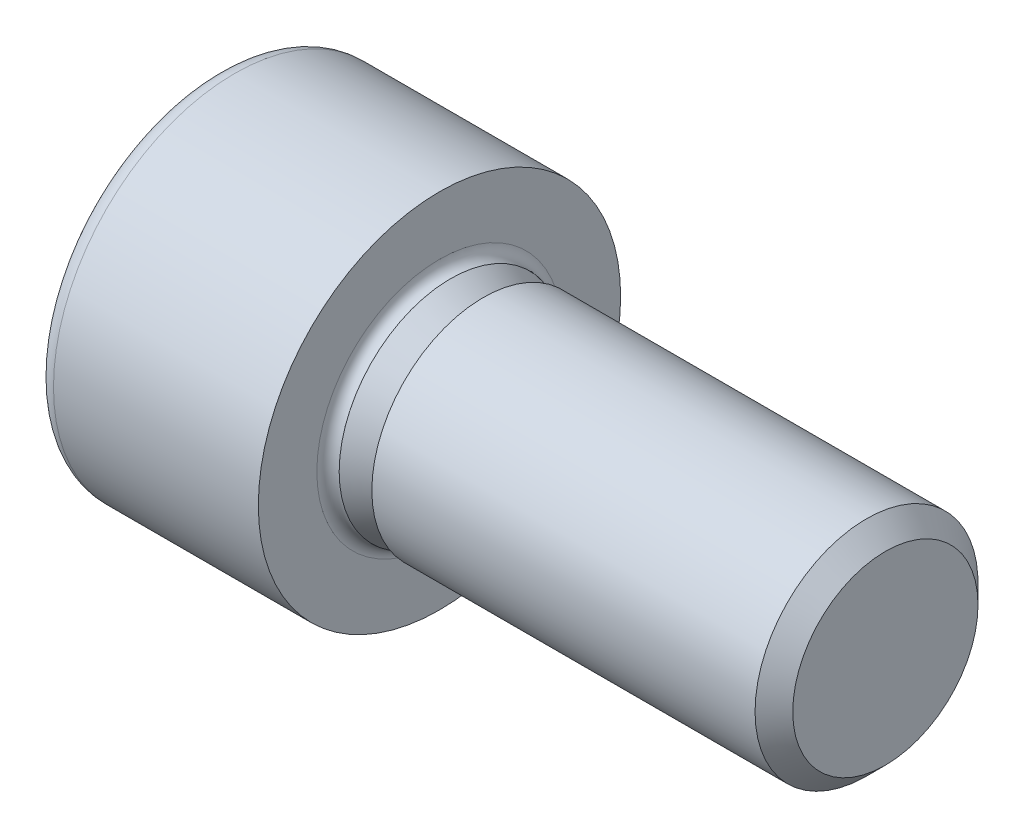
ISO-10303-21;
HEADER;
FILE_DESCRIPTION(('STEP AP214'),'2;1');
FILE_NAME('part.step','',(''),(''),'','','');
FILE_SCHEMA(('AUTOMOTIVE_DESIGN { 1 0 10303 214 1 1 1 1 }'));
ENDSEC;
DATA;
#1=APPLICATION_CONTEXT('core data for automotive mechanical design processes');
#2=APPLICATION_PROTOCOL_DEFINITION('international standard','automotive_design',2000,#1);
#3=PRODUCT_CONTEXT('',#1,'mechanical');
#4=PRODUCT('Part','Part','',(#3));
#5=PRODUCT_RELATED_PRODUCT_CATEGORY('part','',(#4));
#6=PRODUCT_DEFINITION_FORMATION('','',#4);
#7=PRODUCT_DEFINITION_CONTEXT('part definition',#1,'design');
#8=PRODUCT_DEFINITION('design','',#6,#7);
#9=PRODUCT_DEFINITION_SHAPE('','',#8);
#10=(LENGTH_UNIT() NAMED_UNIT(*) SI_UNIT(.MILLI.,.METRE.));
#11=(NAMED_UNIT(*) PLANE_ANGLE_UNIT() SI_UNIT($,.RADIAN.));
#12=(NAMED_UNIT(*) SI_UNIT($,.STERADIAN.) SOLID_ANGLE_UNIT());
#13=UNCERTAINTY_MEASURE_WITH_UNIT(LENGTH_MEASURE(1.E-05),#10,'distance_accuracy_value','');
#14=(GEOMETRIC_REPRESENTATION_CONTEXT(3) GLOBAL_UNCERTAINTY_ASSIGNED_CONTEXT((#13)) GLOBAL_UNIT_ASSIGNED_CONTEXT((#10,
#11,#12)) REPRESENTATION_CONTEXT('',''));
#15=CARTESIAN_POINT('',(0.,0.,0.));
#16=DIRECTION('',(0.,0.,1.));
#17=DIRECTION('',(1.,0.,0.));
#18=AXIS2_PLACEMENT_3D('',#15,#16,#17);
#19=CARTESIAN_POINT('',(-144.,44.,28.));
#20=DIRECTION('',(-1.,0.,0.));
#21=DIRECTION('',(0.,0.,1.));
#22=AXIS2_PLACEMENT_3D('',#19,#20,#21);
#23=PLANE('',#22);
#24=CARTESIAN_POINT('',(-144.,44.,28.));
#25=DIRECTION('',(-1.,0.,0.));
#26=DIRECTION('',(0.,0.,1.));
#27=AXIS2_PLACEMENT_3D('',#24,#25,#26);
#28=CIRCLE('',#27,5.85);
#29=CARTESIAN_POINT('',(-144.,44.,33.85));
#30=VERTEX_POINT('',#29);
#31=EDGE_CURVE('E11',#30,#30,#28,.T.);
#32=ORIENTED_EDGE('',*,*,#31,.T.);
#33=EDGE_LOOP('',(#32));
#34=FACE_BOUND('',#33,.T.);
#35=DIRECTION('',(0.,0.,1.));
#36=VECTOR('',#35,1.);
#37=CARTESIAN_POINT('',(-144.,46.9999986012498,26.26795));
#38=LINE('',#37,#36);
#39=CARTESIAN_POINT('',(-144.,46.9999986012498,26.26795));
#40=VERTEX_POINT('',#39);
#41=CARTESIAN_POINT('',(-144.,46.9999986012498,29.73205));
#42=VERTEX_POINT('',#41);
#43=EDGE_CURVE('E91',#40,#42,#38,.T.);
#44=ORIENTED_EDGE('',*,*,#43,.T.);
#45=DIRECTION('',(0.,-0.866025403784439,0.5));
#46=VECTOR('',#45,1.);
#47=CARTESIAN_POINT('',(-144.,46.9999986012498,29.73205));
#48=LINE('',#47,#46);
#49=CARTESIAN_POINT('',(-144.,44.,31.4641));
#50=VERTEX_POINT('',#49);
#51=EDGE_CURVE('E30',#42,#50,#48,.T.);
#52=ORIENTED_EDGE('',*,*,#51,.T.);
#53=DIRECTION('',(0.,-0.866025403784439,-0.5));
#54=VECTOR('',#53,1.);
#55=CARTESIAN_POINT('',(-144.,44.,31.4641));
#56=LINE('',#55,#54);
#57=CARTESIAN_POINT('',(-144.,41.0000013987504,29.73205));
#58=VERTEX_POINT('',#57);
#59=EDGE_CURVE('E169',#50,#58,#56,.T.);
#60=ORIENTED_EDGE('',*,*,#59,.T.);
#61=DIRECTION('',(0.,0.,-1.));
#62=VECTOR('',#61,1.);
#63=CARTESIAN_POINT('',(-144.,41.0000013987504,29.73205));
#64=LINE('',#63,#62);
#65=CARTESIAN_POINT('',(-144.,41.0000013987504,26.26795));
#66=VERTEX_POINT('',#65);
#67=EDGE_CURVE('E165',#58,#66,#64,.T.);
#68=ORIENTED_EDGE('',*,*,#67,.T.);
#69=DIRECTION('',(0.,0.866025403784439,-0.5));
#70=VECTOR('',#69,1.);
#71=CARTESIAN_POINT('',(-144.,41.0000013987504,26.26795));
#72=LINE('',#71,#70);
#73=CARTESIAN_POINT('',(-144.,44.,24.5359));
#74=VERTEX_POINT('',#73);
#75=EDGE_CURVE('E160',#66,#74,#72,.T.);
#76=ORIENTED_EDGE('',*,*,#75,.T.);
#77=DIRECTION('',(0.,0.866025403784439,0.5));
#78=VECTOR('',#77,1.);
#79=CARTESIAN_POINT('',(-144.,44.,24.5359));
#80=LINE('',#79,#78);
#81=EDGE_CURVE('E95',#74,#40,#80,.T.);
#82=ORIENTED_EDGE('',*,*,#81,.T.);
#83=EDGE_LOOP('',(#44,#52,#60,#68,#76,#82));
#84=FACE_BOUND('',#83,.T.);
#85=ADVANCED_FACE('F16',(#34,#84),#23,.T.);
#86=CARTESIAN_POINT('',(-143.35,44.,28.));
#87=DIRECTION('',(-1.,0.,0.));
#88=DIRECTION('',(0.,0.,1.));
#89=AXIS2_PLACEMENT_3D('',#86,#87,#88);
#90=TOROIDAL_SURFACE('',#89,5.85,0.65);
#91=ORIENTED_EDGE('',*,*,#31,.F.);
#92=EDGE_LOOP('',(#91));
#93=FACE_BOUND('',#92,.T.);
#94=CARTESIAN_POINT('',(-143.35,44.,28.));
#95=DIRECTION('',(-1.,0.,0.));
#96=DIRECTION('',(0.,0.,1.));
#97=AXIS2_PLACEMENT_3D('',#94,#95,#96);
#98=CIRCLE('',#97,6.5);
#99=CARTESIAN_POINT('',(-143.35,44.,34.5));
#100=VERTEX_POINT('',#99);
#101=EDGE_CURVE('E23',#100,#100,#98,.T.);
#102=ORIENTED_EDGE('',*,*,#101,.T.);
#103=EDGE_LOOP('',(#102));
#104=FACE_BOUND('',#103,.T.);
#105=ADVANCED_FACE('F132',(#93,#104),#90,.T.);
#106=CARTESIAN_POINT('',(-144.,44.,28.));
#107=DIRECTION('',(-1.,0.,0.));
#108=DIRECTION('',(0.,0.,1.));
#109=AXIS2_PLACEMENT_3D('',#106,#107,#108);
#110=CYLINDRICAL_SURFACE('',#109,6.5);
#111=CARTESIAN_POINT('',(-136.,44.,28.));
#112=DIRECTION('',(-1.,0.,0.));
#113=DIRECTION('',(0.,0.,1.));
#114=AXIS2_PLACEMENT_3D('',#111,#112,#113);
#115=CIRCLE('',#114,6.5);
#116=CARTESIAN_POINT('',(-136.,44.,34.5));
#117=VERTEX_POINT('',#116);
#118=EDGE_CURVE('E127',#117,#117,#115,.T.);
#119=ORIENTED_EDGE('',*,*,#118,.T.);
#120=EDGE_LOOP('',(#119));
#121=FACE_BOUND('',#120,.T.);
#122=ORIENTED_EDGE('',*,*,#101,.F.);
#123=EDGE_LOOP('',(#122));
#124=FACE_BOUND('',#123,.T.);
#125=ADVANCED_FACE('F134',(#121,#124),#110,.T.);
#126=CARTESIAN_POINT('',(-136.,50.5000000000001,28.));
#127=DIRECTION('',(1.,0.,0.));
#128=DIRECTION('',(0.,0.,-1.));
#129=AXIS2_PLACEMENT_3D('',#126,#127,#128);
#130=PLANE('',#129);
#131=CARTESIAN_POINT('',(-136.,44.,28.));
#132=DIRECTION('',(-1.,0.,0.));
#133=DIRECTION('',(0.,0.,1.));
#134=AXIS2_PLACEMENT_3D('',#131,#132,#133);
#135=CIRCLE('',#134,4.4);
#136=CARTESIAN_POINT('',(-136.,44.,32.4));
#137=VERTEX_POINT('',#136);
#138=EDGE_CURVE('E124',#137,#137,#135,.T.);
#139=ORIENTED_EDGE('',*,*,#138,.T.);
#140=EDGE_LOOP('',(#139));
#141=FACE_BOUND('',#140,.T.);
#142=ORIENTED_EDGE('',*,*,#118,.F.);
#143=EDGE_LOOP('',(#142));
#144=FACE_BOUND('',#143,.T.);
#145=ADVANCED_FACE('F136',(#141,#144),#130,.T.);
#146=CARTESIAN_POINT('',(-135.6,44.,28.));
#147=DIRECTION('',(-1.,0.,0.));
#148=DIRECTION('',(0.,0.,1.));
#149=AXIS2_PLACEMENT_3D('',#146,#147,#148);
#150=TOROIDAL_SURFACE('',#149,4.4,0.4);
#151=CARTESIAN_POINT('',(-135.6,44.,28.));
#152=DIRECTION('',(-1.,0.,0.));
#153=DIRECTION('',(0.,0.,1.));
#154=AXIS2_PLACEMENT_3D('',#151,#152,#153);
#155=CIRCLE('',#154,4.);
#156=CARTESIAN_POINT('',(-135.6,44.,32.));
#157=VERTEX_POINT('',#156);
#158=EDGE_CURVE('E121',#157,#157,#155,.T.);
#159=ORIENTED_EDGE('',*,*,#158,.T.);
#160=EDGE_LOOP('',(#159));
#161=FACE_BOUND('',#160,.T.);
#162=ORIENTED_EDGE('',*,*,#138,.F.);
#163=EDGE_LOOP('',(#162));
#164=FACE_BOUND('',#163,.T.);
#165=ADVANCED_FACE('F143',(#161,#164),#150,.F.);
#166=CARTESIAN_POINT('',(-144.,44.,28.));
#167=DIRECTION('',(-1.,0.,0.));
#168=DIRECTION('',(0.,0.,1.));
#169=AXIS2_PLACEMENT_3D('',#166,#167,#168);
#170=CYLINDRICAL_SURFACE('',#169,4.);
#171=CARTESIAN_POINT('',(-135.599,44.,28.));
#172=DIRECTION('',(-1.,0.,0.));
#173=DIRECTION('',(0.,0.,1.));
#174=AXIS2_PLACEMENT_3D('',#171,#172,#173);
#175=CIRCLE('',#174,4.);
#176=CARTESIAN_POINT('',(-135.599,44.,32.));
#177=VERTEX_POINT('',#176);
#178=EDGE_CURVE('E118',#177,#177,#175,.T.);
#179=ORIENTED_EDGE('',*,*,#178,.T.);
#180=EDGE_LOOP('',(#179));
#181=FACE_BOUND('',#180,.T.);
#182=ORIENTED_EDGE('',*,*,#158,.F.);
#183=EDGE_LOOP('',(#182));
#184=FACE_BOUND('',#183,.T.);
#185=ADVANCED_FACE('F267',(#181,#184),#170,.T.);
#186=CARTESIAN_POINT('',(-135.599,44.,28.));
#187=DIRECTION('',(-1.,0.,0.));
#188=DIRECTION('',(0.,0.,1.));
#189=AXIS2_PLACEMENT_3D('',#186,#187,#188);
#190=CONICAL_SURFACE('',#189,4.,0.523598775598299);
#191=CARTESIAN_POINT('',(-134.427159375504,44.,28.));
#192=DIRECTION('',(-1.,0.,0.));
#193=DIRECTION('',(0.,0.,1.));
#194=AXIS2_PLACEMENT_3D('',#191,#192,#193);
#195=CIRCLE('',#194,3.3234375);
#196=CARTESIAN_POINT('',(-134.427159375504,44.,31.3234375));
#197=VERTEX_POINT('',#196);
#198=EDGE_CURVE('E115',#197,#197,#195,.T.);
#199=ORIENTED_EDGE('',*,*,#198,.T.);
#200=EDGE_LOOP('',(#199));
#201=FACE_BOUND('',#200,.T.);
#202=ORIENTED_EDGE('',*,*,#178,.F.);
#203=EDGE_LOOP('',(#202));
#204=FACE_BOUND('',#203,.T.);
#205=ADVANCED_FACE('F261',(#201,#204),#190,.T.);
#206=CARTESIAN_POINT('',(-134.427159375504,47.3234375,28.));
#207=DIRECTION('',(-1.,0.,0.));
#208=DIRECTION('',(0.,0.,1.));
#209=AXIS2_PLACEMENT_3D('',#206,#207,#208);
#210=PLANE('',#209);
#211=CARTESIAN_POINT('',(-134.427159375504,44.,28.));
#212=DIRECTION('',(-1.,0.,0.));
#213=DIRECTION('',(0.,0.,1.));
#214=AXIS2_PLACEMENT_3D('',#211,#212,#213);
#215=CIRCLE('',#214,4.);
#216=CARTESIAN_POINT('',(-134.427159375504,44.,32.));
#217=VERTEX_POINT('',#216);
#218=EDGE_CURVE('E112',#217,#217,#215,.T.);
#219=ORIENTED_EDGE('',*,*,#218,.T.);
#220=EDGE_LOOP('',(#219));
#221=FACE_BOUND('',#220,.T.);
#222=ORIENTED_EDGE('',*,*,#198,.F.);
#223=EDGE_LOOP('',(#222));
#224=FACE_BOUND('',#223,.T.);
#225=ADVANCED_FACE('F255',(#221,#224),#210,.T.);
#226=CARTESIAN_POINT('',(-144.,44.,28.));
#227=DIRECTION('',(-1.,0.,0.));
#228=DIRECTION('',(0.,0.,1.));
#229=AXIS2_PLACEMENT_3D('',#226,#227,#228);
#230=CYLINDRICAL_SURFACE('',#229,4.);
#231=CARTESIAN_POINT('',(-120.6765625,44.,28.));
#232=DIRECTION('',(-1.,0.,0.));
#233=DIRECTION('',(0.,0.,1.));
#234=AXIS2_PLACEMENT_3D('',#231,#232,#233);
#235=CIRCLE('',#234,4.);
#236=CARTESIAN_POINT('',(-120.6765625,44.,32.));
#237=VERTEX_POINT('',#236);
#238=EDGE_CURVE('E109',#237,#237,#235,.T.);
#239=ORIENTED_EDGE('',*,*,#238,.T.);
#240=EDGE_LOOP('',(#239));
#241=FACE_BOUND('',#240,.T.);
#242=ORIENTED_EDGE('',*,*,#218,.F.);
#243=EDGE_LOOP('',(#242));
#244=FACE_BOUND('',#243,.T.);
#245=ADVANCED_FACE('F249',(#241,#244),#230,.T.);
#246=CARTESIAN_POINT('',(-120.6765625,44.,28.));
#247=DIRECTION('',(-1.,0.,0.));
#248=DIRECTION('',(0.,0.,1.));
#249=AXIS2_PLACEMENT_3D('',#246,#247,#248);
#250=CONICAL_SURFACE('',#249,4.,0.785398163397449);
#251=CARTESIAN_POINT('',(-120.,44.,28.));
#252=DIRECTION('',(-1.,0.,0.));
#253=DIRECTION('',(0.,0.,1.));
#254=AXIS2_PLACEMENT_3D('',#251,#252,#253);
#255=CIRCLE('',#254,3.3234375);
#256=CARTESIAN_POINT('',(-120.,44.,31.3234375));
#257=VERTEX_POINT('',#256);
#258=EDGE_CURVE('E106',#257,#257,#255,.T.);
#259=ORIENTED_EDGE('',*,*,#258,.T.);
#260=EDGE_LOOP('',(#259));
#261=FACE_BOUND('',#260,.T.);
#262=ORIENTED_EDGE('',*,*,#238,.F.);
#263=EDGE_LOOP('',(#262));
#264=FACE_BOUND('',#263,.T.);
#265=ADVANCED_FACE('F244',(#261,#264),#250,.T.);
#266=CARTESIAN_POINT('',(-120.,47.3234375,28.));
#267=DIRECTION('',(1.,0.,0.));
#268=DIRECTION('',(0.,0.,-1.));
#269=AXIS2_PLACEMENT_3D('',#266,#267,#268);
#270=PLANE('',#269);
#271=ORIENTED_EDGE('',*,*,#258,.F.);
#272=EDGE_LOOP('',(#271));
#273=FACE_BOUND('',#272,.T.);
#274=ADVANCED_FACE('F224',(#273),#270,.T.);
#275=CARTESIAN_POINT('',(-138.0000009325,46.9999986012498,29.73205));
#276=DIRECTION('',(0.,-0.5,-0.866025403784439));
#277=DIRECTION('',(0.,0.866025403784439,-0.5));
#278=AXIS2_PLACEMENT_3D('',#275,#276,#277);
#279=PLANE('',#278);
#280=DIRECTION('',(-1.,0.,0.));
#281=VECTOR('',#280,1.);
#282=CARTESIAN_POINT('',(-138.0000009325,44.,31.4641));
#283=LINE('',#282,#281);
#284=CARTESIAN_POINT('',(-140.,44.,31.4641));
#285=VERTEX_POINT('',#284);
#286=EDGE_CURVE('E104',#285,#50,#283,.T.);
#287=ORIENTED_EDGE('',*,*,#286,.T.);
#288=ORIENTED_EDGE('',*,*,#51,.F.);
#289=DIRECTION('',(-1.,0.,0.));
#290=VECTOR('',#289,1.);
#291=CARTESIAN_POINT('',(-138.0000009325,46.9999986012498,29.73205));
#292=LINE('',#291,#290);
#293=CARTESIAN_POINT('',(-140.,46.9999986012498,29.73205));
#294=VERTEX_POINT('',#293);
#295=EDGE_CURVE('E85',#294,#42,#292,.T.);
#296=ORIENTED_EDGE('',*,*,#295,.F.);
#297=CARTESIAN_POINT('',(-140.000000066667,43.9999998,31.46410011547));
#298=CARTESIAN_POINT('',(-139.956043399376,44.1318315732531,31.3879870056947));
#299=CARTESIAN_POINT('',(-139.916067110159,44.2648013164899,31.3112168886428));
#300=CARTESIAN_POINT('',(-139.846289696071,44.5330430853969,31.1563474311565));
#301=CARTESIAN_POINT('',(-139.816513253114,44.6683198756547,31.078245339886));
#302=CARTESIAN_POINT('',(-139.770164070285,44.9371970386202,30.9230090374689));
#303=CARTESIAN_POINT('',(-139.753282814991,45.070756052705,30.8458987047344));
#304=CARTESIAN_POINT('',(-139.733133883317,45.338502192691,30.691315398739));
#305=CARTESIAN_POINT('',(-139.72984951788,45.4726883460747,30.6138429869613));
#306=CARTESIAN_POINT('',(-139.736699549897,45.7234008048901,30.4690940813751));
#307=CARTESIAN_POINT('',(-139.74515203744,45.8399647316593,30.4017958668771));
#308=CARTESIAN_POINT('',(-139.771936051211,46.0723332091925,30.2676378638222));
#309=CARTESIAN_POINT('',(-139.790276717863,46.188136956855,30.200778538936));
#310=CARTESIAN_POINT('',(-139.836124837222,46.4209841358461,30.0663441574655));
#311=CARTESIAN_POINT('',(-139.863826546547,46.5379981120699,29.9987861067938));
#312=CARTESIAN_POINT('',(-139.926697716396,46.770281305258,29.8646773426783));
#313=CARTESIAN_POINT('',(-139.961852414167,46.885553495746,29.79812491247));
#314=CARTESIAN_POINT('',(-140.000000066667,46.9999988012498,29.7320498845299));
#315=B_SPLINE_CURVE_WITH_KNOTS('',3,(#297,#298,#299,#300,#301,#302,#303,#304,#305,#306,#307,
#308,#309,#310,#311,#312,#313,#314),.UNSPECIFIED.,.F.,.F.,(4,2,2,2,2,2,2,2,4),(0.,
0.475523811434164,0.952190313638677,1.41706079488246,1.88136051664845,2.28556077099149,
2.69013530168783,3.1036813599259,3.51641580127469),.UNSPECIFIED.);
#316=EDGE_CURVE('E78',#285,#294,#315,.T.);
#317=ORIENTED_EDGE('',*,*,#316,.F.);
#318=EDGE_LOOP('',(#287,#288,#296,#317));
#319=FACE_BOUND('',#318,.T.);
#320=ADVANCED_FACE('F86',(#319),#279,.T.);
#321=CARTESIAN_POINT('',(-138.0000009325,44.,31.4641));
#322=DIRECTION('',(0.,0.5,-0.866025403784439));
#323=DIRECTION('',(0.,0.866025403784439,0.5));
#324=AXIS2_PLACEMENT_3D('',#321,#322,#323);
#325=PLANE('',#324);
#326=DIRECTION('',(-1.,0.,0.));
#327=VECTOR('',#326,1.);
#328=CARTESIAN_POINT('',(-138.0000009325,41.0000013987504,29.73205));
#329=LINE('',#328,#327);
#330=CARTESIAN_POINT('',(-140.,41.0000013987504,29.73205));
#331=VERTEX_POINT('',#330);
#332=EDGE_CURVE('E102',#331,#58,#329,.T.);
#333=ORIENTED_EDGE('',*,*,#332,.T.);
#334=ORIENTED_EDGE('',*,*,#59,.F.);
#335=ORIENTED_EDGE('',*,*,#286,.F.);
#336=CARTESIAN_POINT('',(-140.000000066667,41.0000011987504,29.7320498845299));
#337=CARTESIAN_POINT('',(-139.956043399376,41.1318329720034,29.8081629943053));
#338=CARTESIAN_POINT('',(-139.916067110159,41.2648027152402,29.8849331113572));
#339=CARTESIAN_POINT('',(-139.846289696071,41.5330444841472,30.0398025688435));
#340=CARTESIAN_POINT('',(-139.816513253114,41.6683212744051,30.117904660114));
#341=CARTESIAN_POINT('',(-139.770164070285,41.9371984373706,30.2731409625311));
#342=CARTESIAN_POINT('',(-139.753282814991,42.0707574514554,30.3502512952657));
#343=CARTESIAN_POINT('',(-139.733133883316,42.3385035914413,30.504834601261));
#344=CARTESIAN_POINT('',(-139.72984951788,42.4726897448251,30.5823070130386));
#345=CARTESIAN_POINT('',(-139.736699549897,42.7234022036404,30.7270559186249));
#346=CARTESIAN_POINT('',(-139.74515203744,42.8399661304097,30.7943541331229));
#347=CARTESIAN_POINT('',(-139.771936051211,43.0723346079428,30.9285121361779));
#348=CARTESIAN_POINT('',(-139.790276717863,43.1881383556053,30.995371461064));
#349=CARTESIAN_POINT('',(-139.836124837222,43.4209855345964,31.1298058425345));
#350=CARTESIAN_POINT('',(-139.863826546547,43.5379995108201,31.1973638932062));
#351=CARTESIAN_POINT('',(-139.926697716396,43.7702827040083,31.3314726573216));
#352=CARTESIAN_POINT('',(-139.961852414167,43.8855548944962,31.3980250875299));
#353=CARTESIAN_POINT('',(-140.000000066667,44.0000002,31.46410011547));
#354=B_SPLINE_CURVE_WITH_KNOTS('',3,(#336,#337,#338,#339,#340,#341,#342,#343,#344,#345,#346,
#347,#348,#349,#350,#351,#352,#353),.UNSPECIFIED.,.F.,.F.,(4,2,2,2,2,2,2,2,4),(0.,
0.475523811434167,0.952190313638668,1.41706079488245,1.88136051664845,2.28556077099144,
2.69013530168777,3.10368135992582,3.51641580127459),.UNSPECIFIED.);
#355=EDGE_CURVE('E82',#331,#285,#354,.T.);
#356=ORIENTED_EDGE('',*,*,#355,.F.);
#357=EDGE_LOOP('',(#333,#334,#335,#356));
#358=FACE_BOUND('',#357,.T.);
#359=ADVANCED_FACE('F215',(#358),#325,.T.);
#360=CARTESIAN_POINT('',(-138.0000009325,41.0000013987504,29.73205));
#361=DIRECTION('',(0.,1.,0.));
#362=DIRECTION('',(0.,0.,1.));
#363=AXIS2_PLACEMENT_3D('',#360,#361,#362);
#364=PLANE('',#363);
#365=DIRECTION('',(-1.,0.,0.));
#366=VECTOR('',#365,1.);
#367=CARTESIAN_POINT('',(-138.0000009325,41.0000013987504,26.26795));
#368=LINE('',#367,#366);
#369=CARTESIAN_POINT('',(-140.,41.0000013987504,26.26795));
#370=VERTEX_POINT('',#369);
#371=EDGE_CURVE('E100',#370,#66,#368,.T.);
#372=ORIENTED_EDGE('',*,*,#371,.T.);
#373=ORIENTED_EDGE('',*,*,#67,.F.);
#374=ORIENTED_EDGE('',*,*,#332,.F.);
#375=CARTESIAN_POINT('',(-141.115505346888,41.0000013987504,23.5145667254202));
#376=CARTESIAN_POINT('',(-141.053352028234,41.0000013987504,23.6441169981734));
#377=CARTESIAN_POINT('',(-140.991844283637,41.0000013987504,23.7739828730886));
#378=CARTESIAN_POINT('',(-140.870486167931,41.0000013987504,24.0345140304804));
#379=CARTESIAN_POINT('',(-140.810636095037,41.0000013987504,24.1651794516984));
#380=CARTESIAN_POINT('',(-140.692625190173,41.0000013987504,24.4282271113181));
#381=CARTESIAN_POINT('',(-140.634476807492,41.0000013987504,24.5606149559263));
#382=CARTESIAN_POINT('',(-140.520787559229,41.0000013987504,24.826501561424));
#383=CARTESIAN_POINT('',(-140.46524655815,41.0000013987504,24.9600002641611));
#384=CARTESIAN_POINT('',(-140.356052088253,41.0000013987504,25.2318375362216));
#385=CARTESIAN_POINT('',(-140.30248593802,41.0000013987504,25.3702113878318));
#386=CARTESIAN_POINT('',(-140.199807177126,41.0000013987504,25.6486328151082));
#387=CARTESIAN_POINT('',(-140.150695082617,41.0000013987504,25.7886805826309));
#388=CARTESIAN_POINT('',(-140.058326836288,41.0000013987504,26.0703553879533));
#389=CARTESIAN_POINT('',(-140.015057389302,41.0000013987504,26.2119780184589));
#390=CARTESIAN_POINT('',(-139.93586037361,41.0000013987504,26.4972404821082));
#391=CARTESIAN_POINT('',(-139.899930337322,41.0000013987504,26.6408796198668));
#392=CARTESIAN_POINT('',(-139.837321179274,41.0000013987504,26.9298944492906));
#393=CARTESIAN_POINT('',(-139.810623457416,41.0000013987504,27.0752660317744));
#394=CARTESIAN_POINT('',(-139.768229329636,41.0000013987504,27.3676355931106));
#395=CARTESIAN_POINT('',(-139.752532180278,41.0000013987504,27.5146334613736));
#396=CARTESIAN_POINT('',(-139.733595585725,41.0000013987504,27.807680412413));
#397=CARTESIAN_POINT('',(-139.730209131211,41.0000013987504,27.9537197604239));
#398=CARTESIAN_POINT('',(-139.735803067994,41.0000013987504,28.2455701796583));
#399=CARTESIAN_POINT('',(-139.744784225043,41.0000013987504,28.3913812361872));
#400=CARTESIAN_POINT('',(-139.770439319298,41.0000013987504,28.643868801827));
#401=CARTESIAN_POINT('',(-139.784492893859,41.0000013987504,28.7508244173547));
#402=CARTESIAN_POINT('',(-139.818287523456,41.0000013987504,28.9638398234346));
#403=CARTESIAN_POINT('',(-139.838029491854,41.0000013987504,29.069899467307));
#404=CARTESIAN_POINT('',(-139.904737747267,41.0000013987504,29.3866523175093));
#405=CARTESIAN_POINT('',(-139.959170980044,41.0000013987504,29.5957844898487));
#406=CARTESIAN_POINT('',(-140.052159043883,41.0000013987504,29.9084746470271));
#407=CARTESIAN_POINT('',(-140.085473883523,41.0000013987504,30.0136812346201));
#408=CARTESIAN_POINT('',(-140.155205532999,41.0000013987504,30.2230712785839));
#409=CARTESIAN_POINT('',(-140.191622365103,41.0000013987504,30.3272547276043));
#410=CARTESIAN_POINT('',(-140.267003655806,41.0000013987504,30.5346401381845));
#411=CARTESIAN_POINT('',(-140.305967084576,41.0000013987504,30.6378424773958));
#412=CARTESIAN_POINT('',(-140.386019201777,41.0000013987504,30.8434153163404));
#413=CARTESIAN_POINT('',(-140.427107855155,41.0000013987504,30.9457858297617));
#414=CARTESIAN_POINT('',(-140.534624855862,41.0000013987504,31.2070988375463));
#415=CARTESIAN_POINT('',(-140.602322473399,41.0000013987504,31.3655184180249));
#416=CARTESIAN_POINT('',(-140.740974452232,41.0000013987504,31.6809303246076));
#417=CARTESIAN_POINT('',(-140.811929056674,41.0000013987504,31.8379225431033));
#418=CARTESIAN_POINT('',(-140.956360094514,41.0000013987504,32.1507850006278));
#419=CARTESIAN_POINT('',(-141.029837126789,41.0000013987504,32.306654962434));
#420=CARTESIAN_POINT('',(-141.17875355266,41.0000013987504,32.6174561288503));
#421=CARTESIAN_POINT('',(-141.254192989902,41.0000013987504,32.7723873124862));
#422=CARTESIAN_POINT('',(-141.482999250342,41.0000013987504,33.2364041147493));
#423=CARTESIAN_POINT('',(-141.638682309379,41.0000013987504,33.5443465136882));
#424=CARTESIAN_POINT('',(-141.954027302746,41.0000013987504,34.1581176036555));
#425=CARTESIAN_POINT('',(-142.113688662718,41.0000013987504,34.4639465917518));
#426=CARTESIAN_POINT('',(-142.420575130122,41.0000013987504,35.0453485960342));
#427=CARTESIAN_POINT('',(-142.567551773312,41.0000013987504,35.3210529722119));
#428=CARTESIAN_POINT('',(-142.863179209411,41.0000013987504,35.871576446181));
#429=CARTESIAN_POINT('',(-143.011830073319,41.0000013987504,36.1463955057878));
#430=CARTESIAN_POINT('',(-143.310007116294,41.0000013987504,36.694652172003));
#431=CARTESIAN_POINT('',(-143.459530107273,41.0000013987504,36.9680915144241));
#432=CARTESIAN_POINT('',(-143.759548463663,41.0000013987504,37.5144158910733));
#433=CARTESIAN_POINT('',(-143.910043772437,41.0000013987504,37.7873009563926));
#434=CARTESIAN_POINT('',(-144.060895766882,41.0000013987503,38.0599874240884));
#435=B_SPLINE_CURVE_WITH_KNOTS('',3,(#375,#376,#377,#378,#379,#380,#381,#382,#383,#384,#385,
#386,#387,#388,#389,#390,#391,#392,#393,#394,#395,#396,#397,#398,#399,#400,#401,#402,#403,#404,
#405,#406,#407,#408,#409,#410,#411,#412,#413,#414,#415,#416,#417,#418,#419,#420,#421,#422,#423,
#424,#425,#426,#427,#428,#429,#430,#431,#432,#433,#434),.UNSPECIFIED.,.F.,.F.,(4,2,2,2,2,2,2,2,
2,2,2,2,2,2,2,2,2,2,2,2,2,2,2,2,2,2,2,2,2,4),(0.,0.431070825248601,0.862218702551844,
1.29598193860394,1.72972260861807,2.17480373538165,2.619936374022,3.06403838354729,
3.50799083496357,3.95104358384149,4.39406638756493,4.83178108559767,5.26952288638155,
5.59298785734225,5.91650479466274,6.56394435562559,6.89498708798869,7.22603219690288,
7.55694425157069,7.88785084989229,8.40463217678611,8.92145214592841,9.43839567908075,
9.95535071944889,10.9904746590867,12.0254500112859,12.9627443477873,13.9000785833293,
14.8350286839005,15.7699248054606),.UNSPECIFIED.);
#436=EDGE_CURVE('E207',#370,#331,#435,.T.);
#437=ORIENTED_EDGE('',*,*,#436,.F.);
#438=EDGE_LOOP('',(#372,#373,#374,#437));
#439=FACE_BOUND('',#438,.T.);
#440=ADVANCED_FACE('F212',(#439),#364,.T.);
#441=CARTESIAN_POINT('',(-138.0000009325,41.0000013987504,26.26795));
#442=DIRECTION('',(0.,0.5,0.866025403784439));
#443=DIRECTION('',(0.,-0.866025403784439,0.5));
#444=AXIS2_PLACEMENT_3D('',#441,#442,#443);
#445=PLANE('',#444);
#446=DIRECTION('',(-1.,0.,0.));
#447=VECTOR('',#446,1.);
#448=CARTESIAN_POINT('',(-138.0000009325,44.,24.5359));
#449=LINE('',#448,#447);
#450=CARTESIAN_POINT('',(-140.,44.,24.5359));
#451=VERTEX_POINT('',#450);
#452=EDGE_CURVE('E93',#451,#74,#449,.T.);
#453=ORIENTED_EDGE('',*,*,#452,.T.);
#454=ORIENTED_EDGE('',*,*,#75,.F.);
#455=ORIENTED_EDGE('',*,*,#371,.F.);
#456=CARTESIAN_POINT('',(-140.000000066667,44.0000002,24.53589988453));
#457=CARTESIAN_POINT('',(-139.956043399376,43.868168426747,24.6120129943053));
#458=CARTESIAN_POINT('',(-139.916067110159,43.7351986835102,24.6887831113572));
#459=CARTESIAN_POINT('',(-139.846289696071,43.4669569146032,24.8436525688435));
#460=CARTESIAN_POINT('',(-139.816513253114,43.3316801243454,24.921754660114));
#461=CARTESIAN_POINT('',(-139.770164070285,43.0628029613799,25.0769909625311));
#462=CARTESIAN_POINT('',(-139.753282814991,42.929243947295,25.1541012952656));
#463=CARTESIAN_POINT('',(-139.733133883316,42.6614978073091,25.308684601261));
#464=CARTESIAN_POINT('',(-139.72984951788,42.5273116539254,25.3861570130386));
#465=CARTESIAN_POINT('',(-139.736699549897,42.27659919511,25.5309059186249));
#466=CARTESIAN_POINT('',(-139.74515203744,42.1600352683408,25.5982041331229));
#467=CARTESIAN_POINT('',(-139.771936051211,41.9276667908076,25.7323621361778));
#468=CARTESIAN_POINT('',(-139.790276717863,41.8118630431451,25.7992214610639));
#469=CARTESIAN_POINT('',(-139.836124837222,41.579015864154,25.9336558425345));
#470=CARTESIAN_POINT('',(-139.863826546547,41.4620018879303,26.0012138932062));
#471=CARTESIAN_POINT('',(-139.926697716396,41.2297186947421,26.1353226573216));
#472=CARTESIAN_POINT('',(-139.961852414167,41.1144465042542,26.2018750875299));
#473=CARTESIAN_POINT('',(-140.000000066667,41.0000011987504,26.26795011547));
#474=B_SPLINE_CURVE_WITH_KNOTS('',3,(#456,#457,#458,#459,#460,#461,#462,#463,#464,#465,#466,
#467,#468,#469,#470,#471,#472,#473),.UNSPECIFIED.,.F.,.F.,(4,2,2,2,2,2,2,2,4),(0.,
0.475523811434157,0.95219031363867,1.41706079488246,1.88136051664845,2.28556077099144,
2.69013530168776,3.10368135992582,3.51641580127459),.UNSPECIFIED.);
#475=EDGE_CURVE('E202',#451,#370,#474,.T.);
#476=ORIENTED_EDGE('',*,*,#475,.F.);
#477=EDGE_LOOP('',(#453,#454,#455,#476));
#478=FACE_BOUND('',#477,.T.);
#479=ADVANCED_FACE('F214',(#478),#445,.T.);
#480=CARTESIAN_POINT('',(-138.0000009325,44.,24.5359));
#481=DIRECTION('',(0.,-0.5,0.866025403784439));
#482=DIRECTION('',(0.,-0.866025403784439,-0.5));
#483=AXIS2_PLACEMENT_3D('',#480,#481,#482);
#484=PLANE('',#483);
#485=DIRECTION('',(-1.,0.,0.));
#486=VECTOR('',#485,1.);
#487=CARTESIAN_POINT('',(-138.0000009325,46.9999986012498,26.26795));
#488=LINE('',#487,#486);
#489=CARTESIAN_POINT('',(-140.,46.9999986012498,26.26795));
#490=VERTEX_POINT('',#489);
#491=EDGE_CURVE('E90',#490,#40,#488,.T.);
#492=ORIENTED_EDGE('',*,*,#491,.T.);
#493=ORIENTED_EDGE('',*,*,#81,.F.);
#494=ORIENTED_EDGE('',*,*,#452,.F.);
#495=CARTESIAN_POINT('',(-140.000000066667,46.9999988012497,26.26795011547));
#496=CARTESIAN_POINT('',(-139.956043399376,46.8681670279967,26.1918370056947));
#497=CARTESIAN_POINT('',(-139.916067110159,46.7351972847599,26.1150668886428));
#498=CARTESIAN_POINT('',(-139.846289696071,46.4669555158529,25.9601974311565));
#499=CARTESIAN_POINT('',(-139.816513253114,46.331678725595,25.882095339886));
#500=CARTESIAN_POINT('',(-139.770164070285,46.0628015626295,25.7268590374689));
#501=CARTESIAN_POINT('',(-139.753282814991,45.9292425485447,25.6497487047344));
#502=CARTESIAN_POINT('',(-139.733133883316,45.6614964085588,25.495165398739));
#503=CARTESIAN_POINT('',(-139.72984951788,45.5273102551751,25.4176929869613));
#504=CARTESIAN_POINT('',(-139.736699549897,45.2765977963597,25.2729440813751));
#505=CARTESIAN_POINT('',(-139.74515203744,45.1600338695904,25.2056458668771));
#506=CARTESIAN_POINT('',(-139.771936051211,44.9276653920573,25.0714878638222));
#507=CARTESIAN_POINT('',(-139.790276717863,44.8118616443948,25.004628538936));
#508=CARTESIAN_POINT('',(-139.836124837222,44.5790144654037,24.8701941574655));
#509=CARTESIAN_POINT('',(-139.863826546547,44.46200048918,24.8026361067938));
#510=CARTESIAN_POINT('',(-139.926697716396,44.2297172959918,24.6685273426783));
#511=CARTESIAN_POINT('',(-139.961852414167,44.1144451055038,24.60197491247));
#512=CARTESIAN_POINT('',(-140.000000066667,43.9999998,24.53589988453));
#513=B_SPLINE_CURVE_WITH_KNOTS('',3,(#495,#496,#497,#498,#499,#500,#501,#502,#503,#504,#505,
#506,#507,#508,#509,#510,#511,#512),.UNSPECIFIED.,.F.,.F.,(4,2,2,2,2,2,2,2,4),(0.,
0.475523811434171,0.952190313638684,1.41706079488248,1.88136051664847,2.28556077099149,
2.69013530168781,3.10368135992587,3.51641580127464),.UNSPECIFIED.);
#514=EDGE_CURVE('E38',#490,#451,#513,.T.);
#515=ORIENTED_EDGE('',*,*,#514,.F.);
#516=EDGE_LOOP('',(#492,#493,#494,#515));
#517=FACE_BOUND('',#516,.T.);
#518=ADVANCED_FACE('F159',(#517),#484,.T.);
#519=CARTESIAN_POINT('',(-138.0000009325,46.9999986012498,26.26795));
#520=DIRECTION('',(0.,-1.,0.));
#521=DIRECTION('',(0.,0.,-1.));
#522=AXIS2_PLACEMENT_3D('',#519,#520,#521);
#523=PLANE('',#522);
#524=ORIENTED_EDGE('',*,*,#295,.T.);
#525=ORIENTED_EDGE('',*,*,#43,.F.);
#526=ORIENTED_EDGE('',*,*,#491,.F.);
#527=CARTESIAN_POINT('',(-141.115505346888,46.9999986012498,23.5145667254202));
#528=CARTESIAN_POINT('',(-141.053352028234,46.9999986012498,23.6441169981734));
#529=CARTESIAN_POINT('',(-140.991844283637,46.9999986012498,23.7739828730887));
#530=CARTESIAN_POINT('',(-140.870486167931,46.9999986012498,24.0345140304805));
#531=CARTESIAN_POINT('',(-140.810636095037,46.9999986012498,24.1651794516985));
#532=CARTESIAN_POINT('',(-140.692625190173,46.9999986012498,24.4282271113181));
#533=CARTESIAN_POINT('',(-140.634476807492,46.9999986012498,24.5606149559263));
#534=CARTESIAN_POINT('',(-140.520787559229,46.9999986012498,24.826501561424));
#535=CARTESIAN_POINT('',(-140.46524655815,46.9999986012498,24.9600002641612));
#536=CARTESIAN_POINT('',(-140.356052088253,46.9999986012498,25.2318375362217));
#537=CARTESIAN_POINT('',(-140.30248593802,46.9999986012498,25.3702113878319));
#538=CARTESIAN_POINT('',(-140.199807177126,46.9999986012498,25.6486328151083));
#539=CARTESIAN_POINT('',(-140.150695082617,46.9999986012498,25.7886805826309));
#540=CARTESIAN_POINT('',(-140.058326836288,46.9999986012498,26.0703553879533));
#541=CARTESIAN_POINT('',(-140.015057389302,46.9999986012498,26.2119780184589));
#542=CARTESIAN_POINT('',(-139.93586037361,46.9999986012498,26.4972404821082));
#543=CARTESIAN_POINT('',(-139.899930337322,46.9999986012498,26.6408796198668));
#544=CARTESIAN_POINT('',(-139.837321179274,46.9999986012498,26.9298944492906));
#545=CARTESIAN_POINT('',(-139.810623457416,46.9999986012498,27.0752660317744));
#546=CARTESIAN_POINT('',(-139.768229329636,46.9999986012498,27.3676355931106));
#547=CARTESIAN_POINT('',(-139.752532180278,46.9999986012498,27.5146334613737));
#548=CARTESIAN_POINT('',(-139.733595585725,46.9999986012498,27.807680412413));
#549=CARTESIAN_POINT('',(-139.730209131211,46.9999986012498,27.9537197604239));
#550=CARTESIAN_POINT('',(-139.735803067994,46.9999986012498,28.2455701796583));
#551=CARTESIAN_POINT('',(-139.744784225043,46.9999986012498,28.3913812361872));
#552=CARTESIAN_POINT('',(-139.770439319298,46.9999986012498,28.643868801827));
#553=CARTESIAN_POINT('',(-139.784492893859,46.9999986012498,28.7508244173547));
#554=CARTESIAN_POINT('',(-139.818287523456,46.9999986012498,28.9638398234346));
#555=CARTESIAN_POINT('',(-139.838029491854,46.9999986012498,29.069899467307));
#556=CARTESIAN_POINT('',(-139.904737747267,46.9999986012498,29.3866523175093));
#557=CARTESIAN_POINT('',(-139.959170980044,46.9999986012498,29.5957844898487));
#558=CARTESIAN_POINT('',(-140.052159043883,46.9999986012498,29.9084746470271));
#559=CARTESIAN_POINT('',(-140.085473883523,46.9999986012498,30.0136812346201));
#560=CARTESIAN_POINT('',(-140.155205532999,46.9999986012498,30.2230712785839));
#561=CARTESIAN_POINT('',(-140.191622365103,46.9999986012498,30.3272547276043));
#562=CARTESIAN_POINT('',(-140.267003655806,46.9999986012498,30.5346401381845));
#563=CARTESIAN_POINT('',(-140.305967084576,46.9999986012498,30.6378424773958));
#564=CARTESIAN_POINT('',(-140.386019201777,46.9999986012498,30.8434153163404));
#565=CARTESIAN_POINT('',(-140.427107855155,46.9999986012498,30.9457858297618));
#566=CARTESIAN_POINT('',(-140.534624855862,46.9999986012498,31.2070988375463));
#567=CARTESIAN_POINT('',(-140.602322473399,46.9999986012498,31.3655184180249));
#568=CARTESIAN_POINT('',(-140.740974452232,46.9999986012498,31.6809303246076));
#569=CARTESIAN_POINT('',(-140.811929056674,46.9999986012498,31.8379225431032));
#570=CARTESIAN_POINT('',(-140.956360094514,46.9999986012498,32.1507850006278));
#571=CARTESIAN_POINT('',(-141.029837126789,46.9999986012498,32.306654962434));
#572=CARTESIAN_POINT('',(-141.17875355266,46.9999986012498,32.6174561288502));
#573=CARTESIAN_POINT('',(-141.254192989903,46.9999986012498,32.7723873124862));
#574=CARTESIAN_POINT('',(-141.482999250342,46.9999986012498,33.2364041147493));
#575=CARTESIAN_POINT('',(-141.638682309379,46.9999986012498,33.5443465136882));
#576=CARTESIAN_POINT('',(-141.954027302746,46.9999986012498,34.1581176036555));
#577=CARTESIAN_POINT('',(-142.113688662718,46.9999986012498,34.4639465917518));
#578=CARTESIAN_POINT('',(-142.420575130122,46.9999986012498,35.0453485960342));
#579=CARTESIAN_POINT('',(-142.567551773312,46.9999986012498,35.3210529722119));
#580=CARTESIAN_POINT('',(-142.863179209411,46.9999986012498,35.8715764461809));
#581=CARTESIAN_POINT('',(-143.011830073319,46.9999986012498,36.1463955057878));
#582=CARTESIAN_POINT('',(-143.310007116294,46.9999986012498,36.6946521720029));
#583=CARTESIAN_POINT('',(-143.459530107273,46.9999986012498,36.9680915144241));
#584=CARTESIAN_POINT('',(-143.759548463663,46.9999986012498,37.5144158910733));
#585=CARTESIAN_POINT('',(-143.910043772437,46.9999986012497,37.7873009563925));
#586=CARTESIAN_POINT('',(-144.060895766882,46.9999986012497,38.0599874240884));
#587=B_SPLINE_CURVE_WITH_KNOTS('',3,(#527,#528,#529,#530,#531,#532,#533,#534,#535,#536,#537,
#538,#539,#540,#541,#542,#543,#544,#545,#546,#547,#548,#549,#550,#551,#552,#553,#554,#555,#556,
#557,#558,#559,#560,#561,#562,#563,#564,#565,#566,#567,#568,#569,#570,#571,#572,#573,#574,#575,
#576,#577,#578,#579,#580,#581,#582,#583,#584,#585,#586),.UNSPECIFIED.,.F.,.F.,(4,2,2,2,2,2,2,2,
2,2,2,2,2,2,2,2,2,2,2,2,2,2,2,2,2,2,2,2,2,4),(0.,0.431070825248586,0.862218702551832,
1.29598193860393,1.72972260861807,2.17480373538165,2.61993637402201,3.06403838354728,
3.50799083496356,3.95104358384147,4.39406638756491,4.83178108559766,5.26952288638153,
5.59298785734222,5.9165047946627,6.56394435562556,6.89498708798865,7.22603219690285,
7.55694425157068,7.88785084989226,8.40463217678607,8.92145214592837,9.4383956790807,
9.95535071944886,10.9904746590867,12.0254500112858,12.9627443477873,13.9000785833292,
14.8350286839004,15.7699248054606),.UNSPECIFIED.);
#588=EDGE_CURVE('E79',#294,#490,#587,.F.);
#589=ORIENTED_EDGE('',*,*,#588,.F.);
#590=EDGE_LOOP('',(#524,#525,#526,#589));
#591=FACE_BOUND('',#590,.T.);
#592=ADVANCED_FACE('F74',(#591),#523,.T.);
#593=CARTESIAN_POINT('',(-138.0000009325,44.,28.));
#594=DIRECTION('',(-1.,0.,0.));
#595=DIRECTION('',(0.,0.,1.));
#596=AXIS2_PLACEMENT_3D('',#593,#594,#595);
#597=CONICAL_SURFACE('',#596,0.,1.0471975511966);
#598=CARTESIAN_POINT('',(-138.0000009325,44.,28.));
#599=VERTEX_POINT('',#598);
#600=VERTEX_LOOP('',#599);
#601=FACE_BOUND('',#600,.T.);
#602=ORIENTED_EDGE('',*,*,#316,.T.);
#603=ORIENTED_EDGE('',*,*,#588,.T.);
#604=ORIENTED_EDGE('',*,*,#514,.T.);
#605=ORIENTED_EDGE('',*,*,#475,.T.);
#606=ORIENTED_EDGE('',*,*,#436,.T.);
#607=ORIENTED_EDGE('',*,*,#355,.T.);
#608=EDGE_LOOP('',(#602,#603,#604,#605,#606,#607));
#609=FACE_BOUND('',#608,.T.);
#610=ADVANCED_FACE('F71',(#601,#609),#597,.F.);
#611=CLOSED_SHELL('',(#85,#105,#125,#145,#165,#185,#205,#225,#245,#265,#274,#320,#359,#440,#479,
#518,#592,#610));
#612=MANIFOLD_SOLID_BREP('B1',#611);
#613=ADVANCED_BREP_SHAPE_REPRESENTATION('',(#18,#612),#14);
#614=SHAPE_DEFINITION_REPRESENTATION(#9,#613);
ENDSEC;
END-ISO-10303-21;
